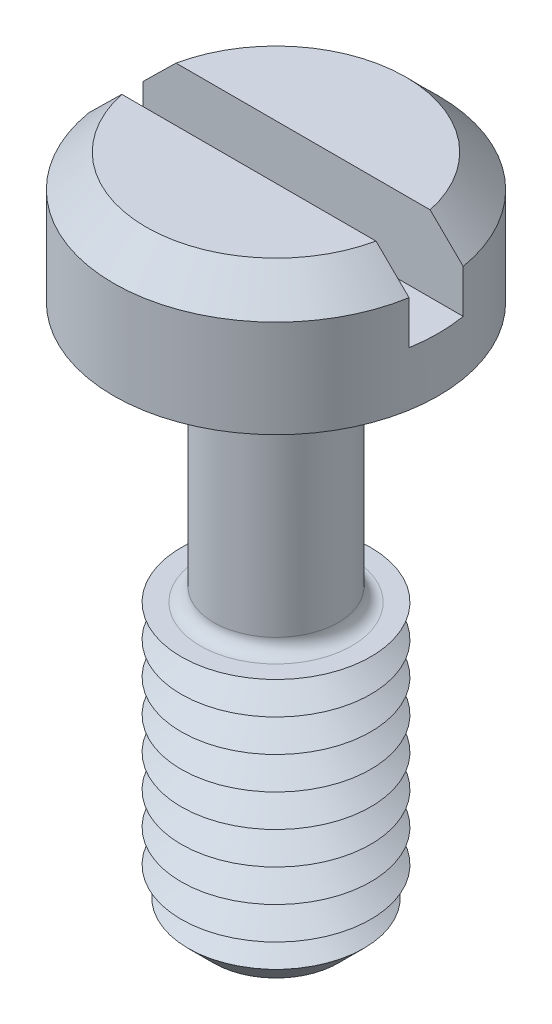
ISO-10303-21;
HEADER;
FILE_DESCRIPTION(('STEP AP214'),'2;1');
FILE_NAME('part.step','',(''),(''),'','','');
FILE_SCHEMA(('AUTOMOTIVE_DESIGN { 1 0 10303 214 1 1 1 1 }'));
ENDSEC;
DATA;
#1=APPLICATION_CONTEXT('core data for automotive mechanical design processes');
#2=APPLICATION_PROTOCOL_DEFINITION('international standard','automotive_design',2000,#1);
#3=PRODUCT_CONTEXT('',#1,'mechanical');
#4=PRODUCT('Part','Part','',(#3));
#5=PRODUCT_RELATED_PRODUCT_CATEGORY('part','',(#4));
#6=PRODUCT_DEFINITION_FORMATION('','',#4);
#7=PRODUCT_DEFINITION_CONTEXT('part definition',#1,'design');
#8=PRODUCT_DEFINITION('design','',#6,#7);
#9=PRODUCT_DEFINITION_SHAPE('','',#8);
#10=(LENGTH_UNIT() NAMED_UNIT(*) SI_UNIT(.MILLI.,.METRE.));
#11=(NAMED_UNIT(*) PLANE_ANGLE_UNIT() SI_UNIT($,.RADIAN.));
#12=(NAMED_UNIT(*) SI_UNIT($,.STERADIAN.) SOLID_ANGLE_UNIT());
#13=UNCERTAINTY_MEASURE_WITH_UNIT(LENGTH_MEASURE(1.E-05),#10,'distance_accuracy_value','');
#14=(GEOMETRIC_REPRESENTATION_CONTEXT(3) GLOBAL_UNCERTAINTY_ASSIGNED_CONTEXT((#13)) GLOBAL_UNIT_ASSIGNED_CONTEXT((#10,
#11,#12)) REPRESENTATION_CONTEXT('',''));
#15=CARTESIAN_POINT('',(0.,0.,0.));
#16=DIRECTION('',(0.,0.,1.));
#17=DIRECTION('',(1.,0.,0.));
#18=AXIS2_PLACEMENT_3D('',#15,#16,#17);
#19=CARTESIAN_POINT('',(0.,2.4,0.));
#20=DIRECTION('',(0.,1.,0.));
#21=DIRECTION('',(0.,0.,1.));
#22=AXIS2_PLACEMENT_3D('',#19,#20,#21);
#23=PLANE('',#22);
#24=DIRECTION('',(-1.,0.,0.));
#25=VECTOR('',#24,1.);
#26=CARTESIAN_POINT('',(3.,2.4,-0.5));
#27=LINE('',#26,#25);
#28=CARTESIAN_POINT('',(2.3473389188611,2.4,-0.5));
#29=VERTEX_POINT('',#28);
#30=CARTESIAN_POINT('',(-2.3473389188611,2.4,-0.5));
#31=VERTEX_POINT('',#30);
#32=EDGE_CURVE('E110',#29,#31,#27,.T.);
#33=ORIENTED_EDGE('',*,*,#32,.F.);
#34=CARTESIAN_POINT('',(0.,2.4,0.));
#35=DIRECTION('',(0.,1.,0.));
#36=DIRECTION('',(0.,0.,1.));
#37=AXIS2_PLACEMENT_3D('',#34,#35,#36);
#38=CIRCLE('',#37,2.4);
#39=EDGE_CURVE('E113',#29,#31,#38,.T.);
#40=ORIENTED_EDGE('',*,*,#39,.T.);
#41=EDGE_LOOP('',(#33,#40));
#42=FACE_BOUND('',#41,.T.);
#43=ADVANCED_FACE('F39',(#42),#23,.T.);
#44=CARTESIAN_POINT('',(0.,2.4,0.));
#45=DIRECTION('',(0.,-1.,0.));
#46=DIRECTION('',(0.,0.,-1.));
#47=AXIS2_PLACEMENT_3D('',#44,#45,#46);
#48=CONICAL_SURFACE('',#47,2.4,0.785398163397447);
#49=CARTESIAN_POINT('',(6.5992407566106,-1.81815522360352,-0.5));
#50=CARTESIAN_POINT('',(6.36552831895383,-1.58511655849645,-0.5));
#51=CARTESIAN_POINT('',(6.13178603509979,-1.35210779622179,-0.5));
#52=CARTESIAN_POINT('',(5.66419282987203,-0.886182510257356,-0.5));
#53=CARTESIAN_POINT('',(5.43034190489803,-0.653265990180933,-0.5));
#54=CARTESIAN_POINT('',(4.96229492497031,-0.187370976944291,-0.5));
#55=CARTESIAN_POINT('',(4.72809874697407,0.0456073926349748,-0.5));
#56=CARTESIAN_POINT('',(4.25949632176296,0.511336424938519,-0.5));
#57=CARTESIAN_POINT('',(4.02509008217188,0.744087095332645,-0.5));
#58=CARTESIAN_POINT('',(3.56605462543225,1.19918528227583,-0.5));
#59=CARTESIAN_POINT('',(3.34144041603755,1.42154792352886,-0.5));
#60=CARTESIAN_POINT('',(3.00406693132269,1.75465797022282,-0.5));
#61=CARTESIAN_POINT('',(2.89152775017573,1.8656282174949,-0.5));
#62=CARTESIAN_POINT('',(2.66624137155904,2.08735508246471,-0.5));
#63=CARTESIAN_POINT('',(2.5534941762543,2.19811170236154,-0.5));
#64=CARTESIAN_POINT('',(2.32775708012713,2.41925708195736,-0.5));
#65=CARTESIAN_POINT('',(2.21476734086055,2.52964600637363,-0.5));
#66=CARTESIAN_POINT('',(1.98831594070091,2.74994787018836,-0.5));
#67=CARTESIAN_POINT('',(1.87485426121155,2.85986079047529,-0.5));
#68=CARTESIAN_POINT('',(1.64719242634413,3.07888083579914,-0.5));
#69=CARTESIAN_POINT('',(1.53299241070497,3.18798810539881,-0.5));
#70=CARTESIAN_POINT('',(1.36063752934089,3.35052419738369,-0.5));
#71=CARTESIAN_POINT('',(1.3030119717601,3.40451369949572,-0.5));
#72=CARTESIAN_POINT('',(1.18725070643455,3.51194233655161,-0.5));
#73=CARTESIAN_POINT('',(1.12911501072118,3.56538148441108,-0.5));
#74=CARTESIAN_POINT('',(1.03810444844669,3.64783932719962,-0.5));
#75=CARTESIAN_POINT('',(1.00549358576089,3.67714917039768,-0.5));
#76=CARTESIAN_POINT('',(0.939964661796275,3.73543047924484,-0.5));
#77=CARTESIAN_POINT('',(0.90704657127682,3.76440191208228,-0.5));
#78=CARTESIAN_POINT('',(0.840581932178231,3.82209234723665,-0.5));
#79=CARTESIAN_POINT('',(0.807032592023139,3.85080814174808,-0.5));
#80=CARTESIAN_POINT('',(0.73940637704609,3.90759649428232,-0.5));
#81=CARTESIAN_POINT('',(0.7053296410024,3.93566921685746,-0.5));
#82=CARTESIAN_POINT('',(0.636165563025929,3.9911274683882,-0.5));
#83=CARTESIAN_POINT('',(0.601072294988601,4.01850564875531,-0.5));
#84=CARTESIAN_POINT('',(0.529844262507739,4.0718678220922,-0.5));
#85=CARTESIAN_POINT('',(0.493709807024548,4.09785222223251,-0.5));
#86=CARTESIAN_POINT('',(0.420142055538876,4.14747983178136,-0.5));
#87=CARTESIAN_POINT('',(0.382717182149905,4.17113535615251,-0.5));
#88=CARTESIAN_POINT('',(0.305809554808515,4.21475217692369,-0.5));
#89=CARTESIAN_POINT('',(0.266332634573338,4.234723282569,-0.5));
#90=CARTESIAN_POINT('',(0.194863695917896,4.26409059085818,-0.5));
#91=CARTESIAN_POINT('',(0.163467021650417,4.27488228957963,-0.5));
#92=CARTESIAN_POINT('',(0.0993951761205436,4.29114651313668,-0.5));
#93=CARTESIAN_POINT('',(0.0667267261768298,4.29664386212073,-0.5));
#94=CARTESIAN_POINT('',(0.000596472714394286,4.30109247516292,-0.5));
#95=CARTESIAN_POINT('',(-0.0328699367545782,4.29998037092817,-0.5));
#96=CARTESIAN_POINT('',(-0.0990204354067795,4.2913596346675,-0.5));
#97=CARTESIAN_POINT('',(-0.131701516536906,4.28382951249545,-0.5));
#98=CARTESIAN_POINT('',(-0.187595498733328,4.2664576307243,-0.5));
#99=CARTESIAN_POINT('',(-0.211151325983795,4.25764794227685,-0.5));
#100=CARTESIAN_POINT('',(-0.257419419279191,4.23801581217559,-0.5));
#101=CARTESIAN_POINT('',(-0.280131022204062,4.22719182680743,-0.5));
#102=CARTESIAN_POINT('',(-0.324887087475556,4.20402808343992,-0.5));
#103=CARTESIAN_POINT('',(-0.346927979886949,4.19168154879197,-0.5));
#104=CARTESIAN_POINT('',(-0.390350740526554,4.16590953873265,-0.5));
#105=CARTESIAN_POINT('',(-0.411732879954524,4.15248451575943,-0.5));
#106=CARTESIAN_POINT('',(-0.483200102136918,4.10572719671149,-0.5));
#107=CARTESIAN_POINT('',(-0.532069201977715,4.07054939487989,-0.5));
#108=CARTESIAN_POINT('',(-0.628034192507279,3.99783710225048,-0.5));
#109=CARTESIAN_POINT('',(-0.67512837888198,3.9603004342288,-0.5));
#110=CARTESIAN_POINT('',(-0.76827763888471,3.88373232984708,-0.5));
#111=CARTESIAN_POINT('',(-0.814329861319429,3.84469743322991,-0.5));
#112=CARTESIAN_POINT('',(-0.905640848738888,3.76575507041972,-0.5));
#113=CARTESIAN_POINT('',(-0.950899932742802,3.72584797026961,-0.5));
#114=CARTESIAN_POINT('',(-1.04097019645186,3.64535266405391,-0.5));
#115=CARTESIAN_POINT('',(-1.08578029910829,3.60476325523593,-0.5));
#116=CARTESIAN_POINT('',(-1.1750143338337,3.52315414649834,-0.5));
#117=CARTESIAN_POINT('',(-1.2194382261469,3.48213440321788,-0.5));
#118=CARTESIAN_POINT('',(-1.35214179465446,3.35874463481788,-0.5));
#119=CARTESIAN_POINT('',(-1.43999477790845,3.27591618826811,-0.5));
#120=CARTESIAN_POINT('',(-1.61421087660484,3.11033648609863,-0.5));
#121=CARTESIAN_POINT('',(-1.70058023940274,3.02759177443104,-0.5));
#122=CARTESIAN_POINT('',(-1.87288923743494,2.86165572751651,-0.5));
#123=CARTESIAN_POINT('',(-1.9588288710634,2.77846439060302,-0.5));
#124=CARTESIAN_POINT('',(-2.21622491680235,2.52844403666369,-0.5));
#125=CARTESIAN_POINT('',(-2.38725269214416,2.36117421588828,-0.5));
#126=CARTESIAN_POINT('',(-2.7288261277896,2.02593191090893,-0.5));
#127=CARTESIAN_POINT('',(-2.8993714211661,1.85795905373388,-0.5));
#128=CARTESIAN_POINT('',(-3.24010524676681,1.52165721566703,-0.5));
#129=CARTESIAN_POINT('',(-3.41029378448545,1.35332824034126,-0.5));
#130=CARTESIAN_POINT('',(-3.75003309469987,1.01685288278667,-0.5));
#131=CARTESIAN_POINT('',(-3.91958441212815,0.848707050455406,-0.5));
#132=CARTESIAN_POINT('',(-4.25853538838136,0.512261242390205,-0.5));
#133=CARTESIAN_POINT('',(-4.4279350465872,0.34396126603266,-0.5));
#134=CARTESIAN_POINT('',(-4.93592097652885,-0.161044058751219,-0.5));
#135=CARTESIAN_POINT('',(-5.2743487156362,-0.497908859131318,-0.5));
#136=CARTESIAN_POINT('',(-5.69486651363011,-0.9167696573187,-0.5));
#137=CARTESIAN_POINT('',(-5.77706453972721,-0.998657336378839,-0.5));
#138=CARTESIAN_POINT('',(-5.94145013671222,-1.16244746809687,-0.5));
#139=CARTESIAN_POINT('',(-6.02363770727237,-1.24434992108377,-0.5));
#140=CARTESIAN_POINT('',(-6.18806790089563,-1.40823159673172,-0.5));
#141=CARTESIAN_POINT('',(-6.27031051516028,-1.49021082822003,-0.5));
#142=CARTESIAN_POINT('',(-6.43478378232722,-1.65417699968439,-0.5));
#143=CARTESIAN_POINT('',(-6.51701443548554,-1.73616393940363,-0.5));
#144=CARTESIAN_POINT('',(-6.5992407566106,-1.81815522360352,-0.5));
#145=B_SPLINE_CURVE_WITH_KNOTS('',3,(#49,#50,#51,#52,#53,#54,#55,#56,#57,#58,#59,#60,#61,#62,
#63,#64,#65,#66,#67,#68,#69,#70,#71,#72,#73,#74,#75,#76,#77,#78,#79,#80,#81,#82,#83,#84,#85,#86,
#87,#88,#89,#90,#91,#92,#93,#94,#95,#96,#97,#98,#99,#100,#101,#102,#103,#104,#105,#106,#107,
#108,#109,#110,#111,#112,#113,#114,#115,#116,#117,#118,#119,#120,#121,#122,#123,#124,#125,#126,
#127,#128,#129,#130,#131,#132,#133,#134,#135,#136,#137,#138,#139,#140,#141,#142,#143,#144),
.UNSPECIFIED.,.F.,.F.,(4,2,2,2,2,2,2,2,2,2,2,2,2,2,2,2,2,2,2,2,2,2,2,2,2,2,2,2,2,2,2,2,2,2,2,2,
2,2,2,2,2,2,2,2,2,2,2,4),(0.,0.990129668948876,1.98029489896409,2.97132503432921,
3.96232055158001,4.91051293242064,5.384659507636,5.85880117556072,6.33268991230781,
6.80659750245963,7.28041788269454,7.51731276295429,7.75420207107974,7.88574051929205,
8.01729161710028,8.14976780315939,8.28220970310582,8.41571746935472,8.54918601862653,
8.68190589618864,8.81426715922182,8.91354607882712,9.01235719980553,9.1121171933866,
9.21221254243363,9.28755627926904,9.36295799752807,9.43870832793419,9.51442704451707,
9.69490147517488,9.87554500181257,10.0566343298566,10.2376490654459,10.4190258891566,
10.6004211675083,10.9626397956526,11.3214656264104,11.6802927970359,12.3979711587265,
13.1160968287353,13.8342113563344,14.5505812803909,15.2669541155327,16.6994694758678,
17.0475484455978,17.3956364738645,17.7440040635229,18.0923625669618),.UNSPECIFIED.);
#146=CARTESIAN_POINT('',(2.95803989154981,1.8,-0.5));
#147=VERTEX_POINT('',#146);
#148=EDGE_CURVE('E258',#147,#29,#145,.T.);
#149=ORIENTED_EDGE('',*,*,#148,.F.);
#150=CARTESIAN_POINT('',(0.,1.8,0.));
#151=DIRECTION('',(0.,1.,0.));
#152=DIRECTION('',(0.,0.,1.));
#153=AXIS2_PLACEMENT_3D('',#150,#151,#152);
#154=CIRCLE('',#153,3.);
#155=CARTESIAN_POINT('',(-2.95803989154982,1.8,-0.5));
#156=VERTEX_POINT('',#155);
#157=EDGE_CURVE('E126',#156,#147,#154,.F.);
#158=ORIENTED_EDGE('',*,*,#157,.F.);
#159=EDGE_CURVE('E102',#31,#156,#145,.T.);
#160=ORIENTED_EDGE('',*,*,#159,.F.);
#161=ORIENTED_EDGE('',*,*,#39,.F.);
#162=EDGE_LOOP('',(#149,#158,#160,#161));
#163=FACE_BOUND('',#162,.T.);
#164=ADVANCED_FACE('F220',(#163),#48,.T.);
#165=CARTESIAN_POINT('',(0.,-10.,0.));
#166=DIRECTION('',(0.,1.,0.));
#167=DIRECTION('',(0.,0.,1.));
#168=AXIS2_PLACEMENT_3D('',#165,#166,#167);
#169=CYLINDRICAL_SURFACE('',#168,1.15);
#170=CARTESIAN_POINT('',(0.,-4.55,0.));
#171=DIRECTION('',(0.,-1.,0.));
#172=DIRECTION('',(0.,0.,-1.));
#173=AXIS2_PLACEMENT_3D('',#170,#171,#172);
#174=CIRCLE('',#173,1.15);
#175=CARTESIAN_POINT('',(0.,-4.55,-1.15));
#176=VERTEX_POINT('',#175);
#177=EDGE_CURVE('E121',#176,#176,#174,.F.);
#178=ORIENTED_EDGE('',*,*,#177,.T.);
#179=EDGE_LOOP('',(#178));
#180=FACE_BOUND('',#179,.T.);
#181=CARTESIAN_POINT('',(0.,-0.25,0.));
#182=DIRECTION('',(0.,1.,0.));
#183=DIRECTION('',(0.,0.,1.));
#184=AXIS2_PLACEMENT_3D('',#181,#182,#183);
#185=CIRCLE('',#184,1.15);
#186=CARTESIAN_POINT('',(0.,-0.25,1.15));
#187=VERTEX_POINT('',#186);
#188=EDGE_CURVE('E365',#187,#187,#185,.F.);
#189=ORIENTED_EDGE('',*,*,#188,.T.);
#190=EDGE_LOOP('',(#189));
#191=FACE_BOUND('',#190,.T.);
#192=ADVANCED_FACE('F216',(#180,#191),#169,.T.);
#193=CARTESIAN_POINT('',(0.,2.4,0.));
#194=DIRECTION('',(0.,-1.,0.));
#195=DIRECTION('',(0.,0.,-1.));
#196=AXIS2_PLACEMENT_3D('',#193,#194,#195);
#197=CYLINDRICAL_SURFACE('',#196,3.);
#198=ORIENTED_EDGE('',*,*,#157,.T.);
#199=DIRECTION('',(0.,-1.,0.));
#200=VECTOR('',#199,1.);
#201=CARTESIAN_POINT('',(2.95803989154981,2.4,-0.5));
#202=LINE('',#201,#200);
#203=CARTESIAN_POINT('',(2.95803989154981,1.,-0.5));
#204=VERTEX_POINT('',#203);
#205=EDGE_CURVE('E64',#147,#204,#202,.T.);
#206=ORIENTED_EDGE('',*,*,#205,.T.);
#207=CARTESIAN_POINT('',(0.,1.,0.));
#208=DIRECTION('',(0.,1.,0.));
#209=DIRECTION('',(0.,0.,1.));
#210=AXIS2_PLACEMENT_3D('',#207,#208,#209);
#211=CIRCLE('',#210,3.);
#212=CARTESIAN_POINT('',(2.95803989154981,1.,0.5));
#213=VERTEX_POINT('',#212);
#214=EDGE_CURVE('E11',#213,#204,#211,.T.);
#215=ORIENTED_EDGE('',*,*,#214,.F.);
#216=DIRECTION('',(0.,-1.,0.));
#217=VECTOR('',#216,1.);
#218=CARTESIAN_POINT('',(2.95803989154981,2.4,0.5));
#219=LINE('',#218,#217);
#220=CARTESIAN_POINT('',(2.95803989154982,1.8,0.5));
#221=VERTEX_POINT('',#220);
#222=EDGE_CURVE('E275',#213,#221,#219,.F.);
#223=ORIENTED_EDGE('',*,*,#222,.T.);
#224=CARTESIAN_POINT('',(-2.95803989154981,1.8,0.5));
#225=VERTEX_POINT('',#224);
#226=EDGE_CURVE('E118',#221,#225,#154,.F.);
#227=ORIENTED_EDGE('',*,*,#226,.T.);
#228=DIRECTION('',(0.,-1.,0.));
#229=VECTOR('',#228,1.);
#230=CARTESIAN_POINT('',(-2.95803989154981,2.4,0.5));
#231=LINE('',#230,#229);
#232=CARTESIAN_POINT('',(-2.95803989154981,1.,0.5));
#233=VERTEX_POINT('',#232);
#234=EDGE_CURVE('E96',#225,#233,#231,.T.);
#235=ORIENTED_EDGE('',*,*,#234,.T.);
#236=CARTESIAN_POINT('',(-2.95803989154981,1.,-0.5));
#237=VERTEX_POINT('',#236);
#238=EDGE_CURVE('E44',#237,#233,#211,.T.);
#239=ORIENTED_EDGE('',*,*,#238,.F.);
#240=DIRECTION('',(0.,-1.,0.));
#241=VECTOR('',#240,1.);
#242=CARTESIAN_POINT('',(-2.95803989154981,2.4,-0.5));
#243=LINE('',#242,#241);
#244=EDGE_CURVE('E279',#237,#156,#243,.F.);
#245=ORIENTED_EDGE('',*,*,#244,.T.);
#246=EDGE_LOOP('',(#198,#206,#215,#223,#227,#235,#239,#245));
#247=FACE_BOUND('',#246,.T.);
#248=CARTESIAN_POINT('',(0.,0.,0.));
#249=DIRECTION('',(0.,1.,0.));
#250=DIRECTION('',(0.,0.,1.));
#251=AXIS2_PLACEMENT_3D('',#248,#249,#250);
#252=CIRCLE('',#251,3.);
#253=CARTESIAN_POINT('',(0.,0.,3.));
#254=VERTEX_POINT('',#253);
#255=EDGE_CURVE('E351',#254,#254,#252,.T.);
#256=ORIENTED_EDGE('',*,*,#255,.T.);
#257=EDGE_LOOP('',(#256));
#258=FACE_BOUND('',#257,.T.);
#259=ADVANCED_FACE('F219',(#247,#258),#197,.T.);
#260=DIRECTION('',(1.,0.,0.));
#261=VECTOR('',#260,1.);
#262=CARTESIAN_POINT('',(3.,2.4,0.5));
#263=LINE('',#262,#261);
#264=CARTESIAN_POINT('',(-2.3473389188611,2.4,0.5));
#265=VERTEX_POINT('',#264);
#266=CARTESIAN_POINT('',(2.3473389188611,2.4,0.5));
#267=VERTEX_POINT('',#266);
#268=EDGE_CURVE('E56',#265,#267,#263,.T.);
#269=ORIENTED_EDGE('',*,*,#268,.F.);
#270=EDGE_CURVE('E108',#265,#267,#38,.T.);
#271=ORIENTED_EDGE('',*,*,#270,.T.);
#272=EDGE_LOOP('',(#269,#271));
#273=FACE_BOUND('',#272,.T.);
#274=ADVANCED_FACE('F107',(#273),#23,.T.);
#275=CARTESIAN_POINT('',(0.,0.,0.));
#276=DIRECTION('',(0.,1.,0.));
#277=DIRECTION('',(0.,0.,1.));
#278=AXIS2_PLACEMENT_3D('',#275,#276,#277);
#279=PLANE('',#278);
#280=CARTESIAN_POINT('',(0.,0.,0.));
#281=DIRECTION('',(0.,1.,0.));
#282=DIRECTION('',(0.,0.,1.));
#283=AXIS2_PLACEMENT_3D('',#280,#281,#282);
#284=CIRCLE('',#283,1.4);
#285=CARTESIAN_POINT('',(0.,0.,1.4));
#286=VERTEX_POINT('',#285);
#287=EDGE_CURVE('E114',#286,#286,#284,.T.);
#288=ORIENTED_EDGE('',*,*,#287,.T.);
#289=EDGE_LOOP('',(#288));
#290=FACE_BOUND('',#289,.T.);
#291=ORIENTED_EDGE('',*,*,#255,.F.);
#292=EDGE_LOOP('',(#291));
#293=FACE_BOUND('',#292,.T.);
#294=ADVANCED_FACE('F210',(#290,#293),#279,.F.);
#295=CARTESIAN_POINT('',(0.,-4.8,0.));
#296=DIRECTION('',(0.,-1.,0.));
#297=DIRECTION('',(0.,0.,-1.));
#298=AXIS2_PLACEMENT_3D('',#295,#296,#297);
#299=PLANE('',#298);
#300=CARTESIAN_POINT('',(0.,-4.8,0.));
#301=DIRECTION('',(0.,-1.,0.));
#302=DIRECTION('',(0.,0.,-1.));
#303=AXIS2_PLACEMENT_3D('',#300,#301,#302);
#304=CIRCLE('',#303,1.4);
#305=CARTESIAN_POINT('',(0.,-4.8,-1.4));
#306=VERTEX_POINT('',#305);
#307=EDGE_CURVE('E358',#306,#306,#304,.T.);
#308=ORIENTED_EDGE('',*,*,#307,.T.);
#309=EDGE_LOOP('',(#308));
#310=FACE_BOUND('',#309,.T.);
#311=CARTESIAN_POINT('',(0.,-4.8,0.));
#312=DIRECTION('',(0.,1.,0.));
#313=DIRECTION('',(0.,0.,1.));
#314=AXIS2_PLACEMENT_3D('',#311,#312,#313);
#315=CIRCLE('',#314,1.75);
#316=CARTESIAN_POINT('',(0.,-4.8,1.75));
#317=VERTEX_POINT('',#316);
#318=EDGE_CURVE('E348',#317,#317,#315,.T.);
#319=ORIENTED_EDGE('',*,*,#318,.T.);
#320=EDGE_LOOP('',(#319));
#321=FACE_BOUND('',#320,.T.);
#322=ADVANCED_FACE('F206',(#310,#321),#299,.F.);
#323=CARTESIAN_POINT('',(0.,-5.1,0.));
#324=DIRECTION('',(0.,1.,0.));
#325=DIRECTION('',(0.,0.,1.));
#326=AXIS2_PLACEMENT_3D('',#323,#324,#325);
#327=CONICAL_SURFACE('',#326,1.23038475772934,1.0471975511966);
#328=ORIENTED_EDGE('',*,*,#318,.F.);
#329=EDGE_LOOP('',(#328));
#330=FACE_BOUND('',#329,.T.);
#331=CARTESIAN_POINT('',(0.,-5.1,0.));
#332=DIRECTION('',(0.,1.,0.));
#333=DIRECTION('',(0.,0.,1.));
#334=AXIS2_PLACEMENT_3D('',#331,#332,#333);
#335=CIRCLE('',#334,1.23038475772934);
#336=CARTESIAN_POINT('',(0.,-5.1,1.23038475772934));
#337=VERTEX_POINT('',#336);
#338=EDGE_CURVE('E344',#337,#337,#335,.T.);
#339=ORIENTED_EDGE('',*,*,#338,.T.);
#340=EDGE_LOOP('',(#339));
#341=FACE_BOUND('',#340,.T.);
#342=ADVANCED_FACE('F202',(#330,#341),#327,.T.);
#343=CARTESIAN_POINT('',(0.,-5.4,0.));
#344=DIRECTION('',(0.,-1.,0.));
#345=DIRECTION('',(0.,0.,-1.));
#346=AXIS2_PLACEMENT_3D('',#343,#344,#345);
#347=CONICAL_SURFACE('',#346,1.75,1.0471975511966);
#348=ORIENTED_EDGE('',*,*,#338,.F.);
#349=EDGE_LOOP('',(#348));
#350=FACE_BOUND('',#349,.T.);
#351=CARTESIAN_POINT('',(0.,-5.4,0.));
#352=DIRECTION('',(0.,1.,0.));
#353=DIRECTION('',(0.,0.,1.));
#354=AXIS2_PLACEMENT_3D('',#351,#352,#353);
#355=CIRCLE('',#354,1.75);
#356=CARTESIAN_POINT('',(0.,-5.4,1.75));
#357=VERTEX_POINT('',#356);
#358=EDGE_CURVE('E341',#357,#357,#355,.T.);
#359=ORIENTED_EDGE('',*,*,#358,.T.);
#360=EDGE_LOOP('',(#359));
#361=FACE_BOUND('',#360,.T.);
#362=ADVANCED_FACE('F198',(#350,#361),#347,.T.);
#363=CARTESIAN_POINT('',(0.,-5.7,0.));
#364=DIRECTION('',(0.,1.,0.));
#365=DIRECTION('',(0.,0.,1.));
#366=AXIS2_PLACEMENT_3D('',#363,#364,#365);
#367=CONICAL_SURFACE('',#366,1.23038475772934,1.0471975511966);
#368=ORIENTED_EDGE('',*,*,#358,.F.);
#369=EDGE_LOOP('',(#368));
#370=FACE_BOUND('',#369,.T.);
#371=CARTESIAN_POINT('',(0.,-5.7,0.));
#372=DIRECTION('',(0.,1.,0.));
#373=DIRECTION('',(0.,0.,1.));
#374=AXIS2_PLACEMENT_3D('',#371,#372,#373);
#375=CIRCLE('',#374,1.23038475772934);
#376=CARTESIAN_POINT('',(0.,-5.7,1.23038475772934));
#377=VERTEX_POINT('',#376);
#378=EDGE_CURVE('E337',#377,#377,#375,.T.);
#379=ORIENTED_EDGE('',*,*,#378,.T.);
#380=EDGE_LOOP('',(#379));
#381=FACE_BOUND('',#380,.T.);
#382=ADVANCED_FACE('F194',(#370,#381),#367,.T.);
#383=CARTESIAN_POINT('',(0.,-6.,0.));
#384=DIRECTION('',(0.,-1.,0.));
#385=DIRECTION('',(0.,0.,-1.));
#386=AXIS2_PLACEMENT_3D('',#383,#384,#385);
#387=CONICAL_SURFACE('',#386,1.75,1.0471975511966);
#388=ORIENTED_EDGE('',*,*,#378,.F.);
#389=EDGE_LOOP('',(#388));
#390=FACE_BOUND('',#389,.T.);
#391=CARTESIAN_POINT('',(0.,-6.,0.));
#392=DIRECTION('',(0.,1.,0.));
#393=DIRECTION('',(0.,0.,1.));
#394=AXIS2_PLACEMENT_3D('',#391,#392,#393);
#395=CIRCLE('',#394,1.75);
#396=CARTESIAN_POINT('',(0.,-6.,1.75));
#397=VERTEX_POINT('',#396);
#398=EDGE_CURVE('E333',#397,#397,#395,.T.);
#399=ORIENTED_EDGE('',*,*,#398,.T.);
#400=EDGE_LOOP('',(#399));
#401=FACE_BOUND('',#400,.T.);
#402=ADVANCED_FACE('F190',(#390,#401),#387,.T.);
#403=CARTESIAN_POINT('',(0.,-6.3,0.));
#404=DIRECTION('',(0.,1.,0.));
#405=DIRECTION('',(0.,0.,1.));
#406=AXIS2_PLACEMENT_3D('',#403,#404,#405);
#407=CONICAL_SURFACE('',#406,1.23038475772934,1.0471975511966);
#408=ORIENTED_EDGE('',*,*,#398,.F.);
#409=EDGE_LOOP('',(#408));
#410=FACE_BOUND('',#409,.T.);
#411=CARTESIAN_POINT('',(0.,-6.3,0.));
#412=DIRECTION('',(0.,1.,0.));
#413=DIRECTION('',(0.,0.,1.));
#414=AXIS2_PLACEMENT_3D('',#411,#412,#413);
#415=CIRCLE('',#414,1.23038475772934);
#416=CARTESIAN_POINT('',(0.,-6.3,1.23038475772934));
#417=VERTEX_POINT('',#416);
#418=EDGE_CURVE('E329',#417,#417,#415,.T.);
#419=ORIENTED_EDGE('',*,*,#418,.T.);
#420=EDGE_LOOP('',(#419));
#421=FACE_BOUND('',#420,.T.);
#422=ADVANCED_FACE('F186',(#410,#421),#407,.T.);
#423=CARTESIAN_POINT('',(0.,-6.6,0.));
#424=DIRECTION('',(0.,-1.,0.));
#425=DIRECTION('',(0.,0.,-1.));
#426=AXIS2_PLACEMENT_3D('',#423,#424,#425);
#427=CONICAL_SURFACE('',#426,1.75,1.0471975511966);
#428=ORIENTED_EDGE('',*,*,#418,.F.);
#429=EDGE_LOOP('',(#428));
#430=FACE_BOUND('',#429,.T.);
#431=CARTESIAN_POINT('',(0.,-6.6,0.));
#432=DIRECTION('',(0.,1.,0.));
#433=DIRECTION('',(0.,0.,1.));
#434=AXIS2_PLACEMENT_3D('',#431,#432,#433);
#435=CIRCLE('',#434,1.75);
#436=CARTESIAN_POINT('',(0.,-6.6,1.75));
#437=VERTEX_POINT('',#436);
#438=EDGE_CURVE('E325',#437,#437,#435,.T.);
#439=ORIENTED_EDGE('',*,*,#438,.T.);
#440=EDGE_LOOP('',(#439));
#441=FACE_BOUND('',#440,.T.);
#442=ADVANCED_FACE('F182',(#430,#441),#427,.T.);
#443=CARTESIAN_POINT('',(0.,-6.9,0.));
#444=DIRECTION('',(0.,1.,0.));
#445=DIRECTION('',(0.,0.,1.));
#446=AXIS2_PLACEMENT_3D('',#443,#444,#445);
#447=CONICAL_SURFACE('',#446,1.23038475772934,1.0471975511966);
#448=ORIENTED_EDGE('',*,*,#438,.F.);
#449=EDGE_LOOP('',(#448));
#450=FACE_BOUND('',#449,.T.);
#451=CARTESIAN_POINT('',(0.,-6.9,0.));
#452=DIRECTION('',(0.,1.,0.));
#453=DIRECTION('',(0.,0.,1.));
#454=AXIS2_PLACEMENT_3D('',#451,#452,#453);
#455=CIRCLE('',#454,1.23038475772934);
#456=CARTESIAN_POINT('',(0.,-6.9,1.23038475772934));
#457=VERTEX_POINT('',#456);
#458=EDGE_CURVE('E321',#457,#457,#455,.T.);
#459=ORIENTED_EDGE('',*,*,#458,.T.);
#460=EDGE_LOOP('',(#459));
#461=FACE_BOUND('',#460,.T.);
#462=ADVANCED_FACE('F178',(#450,#461),#447,.T.);
#463=CARTESIAN_POINT('',(0.,-7.2,0.));
#464=DIRECTION('',(0.,-1.,0.));
#465=DIRECTION('',(0.,0.,-1.));
#466=AXIS2_PLACEMENT_3D('',#463,#464,#465);
#467=CONICAL_SURFACE('',#466,1.75,1.0471975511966);
#468=ORIENTED_EDGE('',*,*,#458,.F.);
#469=EDGE_LOOP('',(#468));
#470=FACE_BOUND('',#469,.T.);
#471=CARTESIAN_POINT('',(0.,-7.2,0.));
#472=DIRECTION('',(0.,1.,0.));
#473=DIRECTION('',(0.,0.,1.));
#474=AXIS2_PLACEMENT_3D('',#471,#472,#473);
#475=CIRCLE('',#474,1.75);
#476=CARTESIAN_POINT('',(0.,-7.2,1.75));
#477=VERTEX_POINT('',#476);
#478=EDGE_CURVE('E317',#477,#477,#475,.T.);
#479=ORIENTED_EDGE('',*,*,#478,.T.);
#480=EDGE_LOOP('',(#479));
#481=FACE_BOUND('',#480,.T.);
#482=ADVANCED_FACE('F174',(#470,#481),#467,.T.);
#483=CARTESIAN_POINT('',(0.,-7.5,0.));
#484=DIRECTION('',(0.,1.,0.));
#485=DIRECTION('',(0.,0.,1.));
#486=AXIS2_PLACEMENT_3D('',#483,#484,#485);
#487=CONICAL_SURFACE('',#486,1.23038475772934,1.0471975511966);
#488=ORIENTED_EDGE('',*,*,#478,.F.);
#489=EDGE_LOOP('',(#488));
#490=FACE_BOUND('',#489,.T.);
#491=CARTESIAN_POINT('',(0.,-7.5,0.));
#492=DIRECTION('',(0.,1.,0.));
#493=DIRECTION('',(0.,0.,1.));
#494=AXIS2_PLACEMENT_3D('',#491,#492,#493);
#495=CIRCLE('',#494,1.23038475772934);
#496=CARTESIAN_POINT('',(0.,-7.5,1.23038475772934));
#497=VERTEX_POINT('',#496);
#498=EDGE_CURVE('E313',#497,#497,#495,.T.);
#499=ORIENTED_EDGE('',*,*,#498,.T.);
#500=EDGE_LOOP('',(#499));
#501=FACE_BOUND('',#500,.T.);
#502=ADVANCED_FACE('F170',(#490,#501),#487,.T.);
#503=CARTESIAN_POINT('',(0.,-7.8,0.));
#504=DIRECTION('',(0.,-1.,0.));
#505=DIRECTION('',(0.,0.,-1.));
#506=AXIS2_PLACEMENT_3D('',#503,#504,#505);
#507=CONICAL_SURFACE('',#506,1.75,1.0471975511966);
#508=ORIENTED_EDGE('',*,*,#498,.F.);
#509=EDGE_LOOP('',(#508));
#510=FACE_BOUND('',#509,.T.);
#511=CARTESIAN_POINT('',(0.,-7.8,0.));
#512=DIRECTION('',(0.,1.,0.));
#513=DIRECTION('',(0.,0.,1.));
#514=AXIS2_PLACEMENT_3D('',#511,#512,#513);
#515=CIRCLE('',#514,1.75);
#516=CARTESIAN_POINT('',(0.,-7.8,1.75));
#517=VERTEX_POINT('',#516);
#518=EDGE_CURVE('E309',#517,#517,#515,.T.);
#519=ORIENTED_EDGE('',*,*,#518,.T.);
#520=EDGE_LOOP('',(#519));
#521=FACE_BOUND('',#520,.T.);
#522=ADVANCED_FACE('F166',(#510,#521),#507,.T.);
#523=CARTESIAN_POINT('',(0.,-8.1,0.));
#524=DIRECTION('',(0.,1.,0.));
#525=DIRECTION('',(0.,0.,1.));
#526=AXIS2_PLACEMENT_3D('',#523,#524,#525);
#527=CONICAL_SURFACE('',#526,1.23038475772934,1.0471975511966);
#528=ORIENTED_EDGE('',*,*,#518,.F.);
#529=EDGE_LOOP('',(#528));
#530=FACE_BOUND('',#529,.T.);
#531=CARTESIAN_POINT('',(0.,-8.1,0.));
#532=DIRECTION('',(0.,1.,0.));
#533=DIRECTION('',(0.,0.,1.));
#534=AXIS2_PLACEMENT_3D('',#531,#532,#533);
#535=CIRCLE('',#534,1.23038475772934);
#536=CARTESIAN_POINT('',(0.,-8.1,1.23038475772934));
#537=VERTEX_POINT('',#536);
#538=EDGE_CURVE('E305',#537,#537,#535,.T.);
#539=ORIENTED_EDGE('',*,*,#538,.T.);
#540=EDGE_LOOP('',(#539));
#541=FACE_BOUND('',#540,.T.);
#542=ADVANCED_FACE('F162',(#530,#541),#527,.T.);
#543=CARTESIAN_POINT('',(0.,-8.4,0.));
#544=DIRECTION('',(0.,-1.,0.));
#545=DIRECTION('',(0.,0.,-1.));
#546=AXIS2_PLACEMENT_3D('',#543,#544,#545);
#547=CONICAL_SURFACE('',#546,1.75,1.0471975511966);
#548=ORIENTED_EDGE('',*,*,#538,.F.);
#549=EDGE_LOOP('',(#548));
#550=FACE_BOUND('',#549,.T.);
#551=CARTESIAN_POINT('',(0.,-8.4,0.));
#552=DIRECTION('',(0.,1.,0.));
#553=DIRECTION('',(0.,0.,1.));
#554=AXIS2_PLACEMENT_3D('',#551,#552,#553);
#555=CIRCLE('',#554,1.75);
#556=CARTESIAN_POINT('',(0.,-8.4,1.75));
#557=VERTEX_POINT('',#556);
#558=EDGE_CURVE('E301',#557,#557,#555,.T.);
#559=ORIENTED_EDGE('',*,*,#558,.T.);
#560=EDGE_LOOP('',(#559));
#561=FACE_BOUND('',#560,.T.);
#562=ADVANCED_FACE('F158',(#550,#561),#547,.T.);
#563=CARTESIAN_POINT('',(0.,-8.7,0.));
#564=DIRECTION('',(0.,1.,0.));
#565=DIRECTION('',(0.,0.,1.));
#566=AXIS2_PLACEMENT_3D('',#563,#564,#565);
#567=CONICAL_SURFACE('',#566,1.23038475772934,1.0471975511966);
#568=ORIENTED_EDGE('',*,*,#558,.F.);
#569=EDGE_LOOP('',(#568));
#570=FACE_BOUND('',#569,.T.);
#571=CARTESIAN_POINT('',(0.,-8.7,0.));
#572=DIRECTION('',(0.,1.,0.));
#573=DIRECTION('',(0.,0.,1.));
#574=AXIS2_PLACEMENT_3D('',#571,#572,#573);
#575=CIRCLE('',#574,1.23038475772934);
#576=CARTESIAN_POINT('',(0.,-8.7,1.23038475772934));
#577=VERTEX_POINT('',#576);
#578=EDGE_CURVE('E297',#577,#577,#575,.T.);
#579=ORIENTED_EDGE('',*,*,#578,.T.);
#580=EDGE_LOOP('',(#579));
#581=FACE_BOUND('',#580,.T.);
#582=ADVANCED_FACE('F154',(#570,#581),#567,.T.);
#583=CARTESIAN_POINT('',(0.,-9.,0.));
#584=DIRECTION('',(0.,-1.,0.));
#585=DIRECTION('',(0.,0.,-1.));
#586=AXIS2_PLACEMENT_3D('',#583,#584,#585);
#587=CONICAL_SURFACE('',#586,1.75,1.0471975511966);
#588=ORIENTED_EDGE('',*,*,#578,.F.);
#589=EDGE_LOOP('',(#588));
#590=FACE_BOUND('',#589,.T.);
#591=CARTESIAN_POINT('',(0.,-9.,0.));
#592=DIRECTION('',(0.,1.,0.));
#593=DIRECTION('',(0.,0.,1.));
#594=AXIS2_PLACEMENT_3D('',#591,#592,#593);
#595=CIRCLE('',#594,1.75);
#596=CARTESIAN_POINT('',(0.,-9.,1.75));
#597=VERTEX_POINT('',#596);
#598=EDGE_CURVE('E292',#597,#597,#595,.T.);
#599=ORIENTED_EDGE('',*,*,#598,.T.);
#600=EDGE_LOOP('',(#599));
#601=FACE_BOUND('',#600,.T.);
#602=ADVANCED_FACE('F150',(#590,#601),#587,.T.);
#603=CARTESIAN_POINT('',(0.,-9.3,0.));
#604=DIRECTION('',(0.,1.,0.));
#605=DIRECTION('',(0.,0.,1.));
#606=AXIS2_PLACEMENT_3D('',#603,#604,#605);
#607=CONICAL_SURFACE('',#606,1.23038475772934,1.0471975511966);
#608=ORIENTED_EDGE('',*,*,#598,.F.);
#609=EDGE_LOOP('',(#608));
#610=FACE_BOUND('',#609,.T.);
#611=CARTESIAN_POINT('',(0.,-9.3,0.));
#612=DIRECTION('',(0.,1.,0.));
#613=DIRECTION('',(0.,0.,1.));
#614=AXIS2_PLACEMENT_3D('',#611,#612,#613);
#615=CIRCLE('',#614,1.23038475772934);
#616=CARTESIAN_POINT('',(0.,-9.3,1.23038475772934));
#617=VERTEX_POINT('',#616);
#618=EDGE_CURVE('E288',#617,#617,#615,.T.);
#619=ORIENTED_EDGE('',*,*,#618,.T.);
#620=EDGE_LOOP('',(#619));
#621=FACE_BOUND('',#620,.T.);
#622=ADVANCED_FACE('F146',(#610,#621),#607,.T.);
#623=CARTESIAN_POINT('',(0.,-9.6,0.));
#624=DIRECTION('',(0.,-1.,0.));
#625=DIRECTION('',(0.,0.,-1.));
#626=AXIS2_PLACEMENT_3D('',#623,#624,#625);
#627=CONICAL_SURFACE('',#626,1.75,1.0471975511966);
#628=CARTESIAN_POINT('',(0.,-9.52679491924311,0.));
#629=DIRECTION('',(0.,-1.,0.));
#630=DIRECTION('',(0.,0.,-1.));
#631=AXIS2_PLACEMENT_3D('',#628,#629,#630);
#632=CIRCLE('',#631,1.62320508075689);
#633=CARTESIAN_POINT('',(0.,-9.52679491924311,1.62320508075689));
#634=VERTEX_POINT('',#633);
#635=EDGE_CURVE('E296',#634,#634,#632,.F.);
#636=ORIENTED_EDGE('',*,*,#635,.T.);
#637=EDGE_LOOP('',(#636));
#638=FACE_BOUND('',#637,.T.);
#639=ORIENTED_EDGE('',*,*,#618,.F.);
#640=EDGE_LOOP('',(#639));
#641=FACE_BOUND('',#640,.T.);
#642=ADVANCED_FACE('F142',(#638,#641),#627,.T.);
#643=CARTESIAN_POINT('',(0.,-10.,0.));
#644=DIRECTION('',(0.,-1.,0.));
#645=DIRECTION('',(0.,0.,-1.));
#646=AXIS2_PLACEMENT_3D('',#643,#644,#645);
#647=PLANE('',#646);
#648=CARTESIAN_POINT('',(0.,-10.,0.));
#649=DIRECTION('',(0.,-1.,0.));
#650=DIRECTION('',(0.,0.,-1.));
#651=AXIS2_PLACEMENT_3D('',#648,#649,#650);
#652=CIRCLE('',#651,1.15);
#653=CARTESIAN_POINT('',(0.,-10.,1.15));
#654=VERTEX_POINT('',#653);
#655=EDGE_CURVE('E355',#654,#654,#652,.T.);
#656=ORIENTED_EDGE('',*,*,#655,.T.);
#657=EDGE_LOOP('',(#656));
#658=FACE_BOUND('',#657,.T.);
#659=ADVANCED_FACE('F145',(#658),#647,.T.);
#660=CARTESIAN_POINT('',(0.,-10.,0.));
#661=DIRECTION('',(0.,1.,0.));
#662=DIRECTION('',(0.,0.,1.));
#663=AXIS2_PLACEMENT_3D('',#660,#661,#662);
#664=CONICAL_SURFACE('',#663,1.15,0.785398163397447);
#665=CARTESIAN_POINT('',(0.,-9.52679491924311,1.62320508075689));
#666=CARTESIAN_POINT('',(0.,-9.53172413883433,1.61827586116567));
#667=CARTESIAN_POINT('',(0.,-9.53665335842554,1.61334664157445));
#668=CARTESIAN_POINT('',(0.,-9.54651179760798,1.60348820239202));
#669=CARTESIAN_POINT('',(0.,-9.5514410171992,1.5985589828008));
#670=CARTESIAN_POINT('',(0.,-9.56129945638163,1.58870054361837));
#671=CARTESIAN_POINT('',(0.,-9.56622867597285,1.58377132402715));
#672=CARTESIAN_POINT('',(0.,-9.57608711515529,1.57391288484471));
#673=CARTESIAN_POINT('',(0.,-9.5810163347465,1.5689836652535));
#674=CARTESIAN_POINT('',(0.,-9.59087477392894,1.55912522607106));
#675=CARTESIAN_POINT('',(0.,-9.59580399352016,1.55419600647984));
#676=CARTESIAN_POINT('',(0.,-9.60566243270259,1.54433756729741));
#677=CARTESIAN_POINT('',(0.,-9.61059165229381,1.53940834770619));
#678=CARTESIAN_POINT('',(0.,-9.62045009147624,1.52954990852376));
#679=CARTESIAN_POINT('',(0.,-9.62537931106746,1.52462068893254));
#680=CARTESIAN_POINT('',(0.,-9.6352377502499,1.5147622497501));
#681=CARTESIAN_POINT('',(0.,-9.64016696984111,1.50983303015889));
#682=CARTESIAN_POINT('',(0.,-9.65002540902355,1.49997459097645));
#683=CARTESIAN_POINT('',(0.,-9.65495462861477,1.49504537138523));
#684=CARTESIAN_POINT('',(0.,-9.6648130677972,1.4851869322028));
#685=CARTESIAN_POINT('',(0.,-9.66974228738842,1.48025771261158));
#686=CARTESIAN_POINT('',(0.,-9.67960072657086,1.47039927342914));
#687=CARTESIAN_POINT('',(0.,-9.68452994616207,1.46547005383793));
#688=CARTESIAN_POINT('',(0.,-9.69438838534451,1.45561161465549));
#689=CARTESIAN_POINT('',(0.,-9.69931760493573,1.45068239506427));
#690=CARTESIAN_POINT('',(0.,-9.70917604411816,1.44082395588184));
#691=CARTESIAN_POINT('',(0.,-9.71410526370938,1.43589473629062));
#692=CARTESIAN_POINT('',(0.,-9.72396370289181,1.42603629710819));
#693=CARTESIAN_POINT('',(0.,-9.72889292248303,1.42110707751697));
#694=CARTESIAN_POINT('',(0.,-9.73875136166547,1.41124863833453));
#695=CARTESIAN_POINT('',(0.,-9.74368058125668,1.40631941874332));
#696=CARTESIAN_POINT('',(0.,-9.75353902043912,1.39646097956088));
#697=CARTESIAN_POINT('',(0.,-9.75846824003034,1.39153175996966));
#698=CARTESIAN_POINT('',(0.,-9.76832667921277,1.38167332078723));
#699=CARTESIAN_POINT('',(0.,-9.77325589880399,1.37674410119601));
#700=CARTESIAN_POINT('',(0.,-9.78311433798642,1.36688566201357));
#701=CARTESIAN_POINT('',(0.,-9.78804355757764,1.36195644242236));
#702=CARTESIAN_POINT('',(0.,-9.79790199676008,1.35209800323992));
#703=CARTESIAN_POINT('',(0.,-9.8028312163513,1.3471687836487));
#704=CARTESIAN_POINT('',(0.,-9.81268965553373,1.33731034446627));
#705=CARTESIAN_POINT('',(0.,-9.81761887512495,1.33238112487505));
#706=CARTESIAN_POINT('',(0.,-9.82747731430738,1.32252268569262));
#707=CARTESIAN_POINT('',(0.,-9.8324065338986,1.3175934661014));
#708=CARTESIAN_POINT('',(0.,-9.84226497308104,1.30773502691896));
#709=CARTESIAN_POINT('',(0.,-9.84719419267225,1.30280580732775));
#710=CARTESIAN_POINT('',(0.,-9.85705263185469,1.29294736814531));
#711=CARTESIAN_POINT('',(0.,-9.86198185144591,1.28801814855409));
#712=CARTESIAN_POINT('',(0.,-9.87184029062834,1.27815970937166));
#713=CARTESIAN_POINT('',(0.,-9.87676951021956,1.27323048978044));
#714=CARTESIAN_POINT('',(0.,-9.88662794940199,1.26337205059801));
#715=CARTESIAN_POINT('',(0.,-9.89155716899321,1.25844283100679));
#716=CARTESIAN_POINT('',(0.,-9.90141560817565,1.24858439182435));
#717=CARTESIAN_POINT('',(0.,-9.90634482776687,1.24365517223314));
#718=CARTESIAN_POINT('',(0.,-9.9162032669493,1.2337967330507));
#719=CARTESIAN_POINT('',(0.,-9.92113248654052,1.22886751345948));
#720=CARTESIAN_POINT('',(0.,-9.93099092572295,1.21900907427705));
#721=CARTESIAN_POINT('',(0.,-9.93592014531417,1.21407985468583));
#722=CARTESIAN_POINT('',(0.,-9.94577858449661,1.20422141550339));
#723=CARTESIAN_POINT('',(0.,-9.95070780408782,1.19929219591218));
#724=CARTESIAN_POINT('',(0.,-9.96056624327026,1.18943375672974));
#725=CARTESIAN_POINT('',(0.,-9.96549546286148,1.18450453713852));
#726=CARTESIAN_POINT('',(0.,-9.97535390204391,1.17464609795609));
#727=CARTESIAN_POINT('',(0.,-9.98028312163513,1.16971687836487));
#728=CARTESIAN_POINT('',(0.,-9.99014156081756,1.15985843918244));
#729=CARTESIAN_POINT('',(0.,-9.99507078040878,1.15492921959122));
#730=CARTESIAN_POINT('',(0.,-10.,1.15));
#731=B_SPLINE_CURVE_WITH_KNOTS('',3,(#665,#666,#667,#668,#669,#670,#671,#672,#673,#674,#675,
#676,#677,#678,#679,#680,#681,#682,#683,#684,#685,#686,#687,#688,#689,#690,#691,#692,#693,#694,
#695,#696,#697,#698,#699,#700,#701,#702,#703,#704,#705,#706,#707,#708,#709,#710,#711,#712,#713,
#714,#715,#716,#717,#718,#719,#720,#721,#722,#723,#724,#725,#726,#727,#728,#729,#730),
.UNSPECIFIED.,.F.,.F.,(4,2,2,2,2,2,2,2,2,2,2,2,2,2,2,2,2,2,2,2,2,2,2,2,2,2,2,2,2,2,2,2,4),(0.,
0.0209129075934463,0.0418258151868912,0.0627387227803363,0.0836516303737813,0.104564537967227,
0.125477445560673,0.146390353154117,0.167303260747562,0.188216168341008,0.209129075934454,
0.230041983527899,0.250954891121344,0.271867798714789,0.292780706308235,0.31369361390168,
0.334606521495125,0.35551942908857,0.376432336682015,0.397345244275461,0.418258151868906,
0.439171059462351,0.460083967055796,0.480996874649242,0.501909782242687,0.522822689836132,
0.543735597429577,0.564648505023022,0.585561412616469,0.606474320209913,0.627387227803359,
0.648300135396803,0.66921304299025),.UNSPECIFIED.);
#732=EDGE_CURVE('BSEAM214',#634,#654,#731,.T.);
#733=ORIENTED_EDGE('',*,*,#635,.F.);
#734=ORIENTED_EDGE('',*,*,#655,.F.);
#735=ORIENTED_EDGE('',*,*,#732,.T.);
#736=ORIENTED_EDGE('',*,*,#732,.F.);
#737=EDGE_LOOP('',(#733,#735,#734,#736));
#738=FACE_BOUND('',#737,.T.);
#739=ADVANCED_FACE('F214',(#738),#664,.T.);
#740=CARTESIAN_POINT('',(0.,-4.55,0.));
#741=DIRECTION('',(0.,-1.,0.));
#742=DIRECTION('',(0.,0.,-1.));
#743=AXIS2_PLACEMENT_3D('',#740,#741,#742);
#744=TOROIDAL_SURFACE('',#743,1.4,0.25);
#745=ORIENTED_EDGE('',*,*,#177,.F.);
#746=EDGE_LOOP('',(#745));
#747=FACE_BOUND('',#746,.T.);
#748=ORIENTED_EDGE('',*,*,#307,.F.);
#749=EDGE_LOOP('',(#748));
#750=FACE_BOUND('',#749,.T.);
#751=ADVANCED_FACE('F232',(#747,#750),#744,.F.);
#752=CARTESIAN_POINT('',(0.,-0.25,0.));
#753=DIRECTION('',(0.,1.,0.));
#754=DIRECTION('',(0.,0.,1.));
#755=AXIS2_PLACEMENT_3D('',#752,#753,#754);
#756=TOROIDAL_SURFACE('',#755,1.4,0.25);
#757=ORIENTED_EDGE('',*,*,#287,.F.);
#758=EDGE_LOOP('',(#757));
#759=FACE_BOUND('',#758,.T.);
#760=ORIENTED_EDGE('',*,*,#188,.F.);
#761=EDGE_LOOP('',(#760));
#762=FACE_BOUND('',#761,.T.);
#763=ADVANCED_FACE('F235',(#759,#762),#756,.F.);
#764=CARTESIAN_POINT('',(-6.5992407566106,-1.81815522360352,0.5));
#765=CARTESIAN_POINT('',(-6.36552831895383,-1.58511655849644,0.5));
#766=CARTESIAN_POINT('',(-6.13178603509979,-1.35210779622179,0.5));
#767=CARTESIAN_POINT('',(-5.66419282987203,-0.886182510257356,0.5));
#768=CARTESIAN_POINT('',(-5.43034190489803,-0.653265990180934,0.5));
#769=CARTESIAN_POINT('',(-4.96229492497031,-0.187370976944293,0.5));
#770=CARTESIAN_POINT('',(-4.72809874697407,0.0456073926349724,0.5));
#771=CARTESIAN_POINT('',(-4.25949632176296,0.511336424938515,0.5));
#772=CARTESIAN_POINT('',(-4.02509008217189,0.744087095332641,0.5));
#773=CARTESIAN_POINT('',(-3.56605462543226,1.19918528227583,0.5));
#774=CARTESIAN_POINT('',(-3.34144041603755,1.42154792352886,0.5));
#775=CARTESIAN_POINT('',(-3.0040669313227,1.75465797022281,0.5));
#776=CARTESIAN_POINT('',(-2.89152775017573,1.8656282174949,0.5));
#777=CARTESIAN_POINT('',(-2.66624137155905,2.0873550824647,0.5));
#778=CARTESIAN_POINT('',(-2.5534941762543,2.19811170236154,0.5));
#779=CARTESIAN_POINT('',(-2.32775708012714,2.41925708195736,0.5));
#780=CARTESIAN_POINT('',(-2.21476734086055,2.52964600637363,0.5));
#781=CARTESIAN_POINT('',(-1.98831594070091,2.74994787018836,0.5));
#782=CARTESIAN_POINT('',(-1.87485426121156,2.85986079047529,0.5));
#783=CARTESIAN_POINT('',(-1.64719242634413,3.07888083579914,0.5));
#784=CARTESIAN_POINT('',(-1.53299241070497,3.18798810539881,0.5));
#785=CARTESIAN_POINT('',(-1.36063752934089,3.35052419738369,0.5));
#786=CARTESIAN_POINT('',(-1.3030119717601,3.40451369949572,0.5));
#787=CARTESIAN_POINT('',(-1.18725070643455,3.51194233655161,0.5));
#788=CARTESIAN_POINT('',(-1.12911501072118,3.56538148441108,0.5));
#789=CARTESIAN_POINT('',(-1.03810444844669,3.64783932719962,0.5));
#790=CARTESIAN_POINT('',(-1.00549358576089,3.67714917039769,0.5));
#791=CARTESIAN_POINT('',(-0.939964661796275,3.73543047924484,0.5));
#792=CARTESIAN_POINT('',(-0.907046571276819,3.76440191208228,0.5));
#793=CARTESIAN_POINT('',(-0.840581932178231,3.82209234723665,0.5));
#794=CARTESIAN_POINT('',(-0.807032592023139,3.85080814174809,0.5));
#795=CARTESIAN_POINT('',(-0.73940637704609,3.90759649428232,0.5));
#796=CARTESIAN_POINT('',(-0.7053296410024,3.93566921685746,0.5));
#797=CARTESIAN_POINT('',(-0.636165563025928,3.9911274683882,0.5));
#798=CARTESIAN_POINT('',(-0.6010722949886,4.01850564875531,0.5));
#799=CARTESIAN_POINT('',(-0.529844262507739,4.0718678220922,0.5));
#800=CARTESIAN_POINT('',(-0.493709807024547,4.09785222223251,0.5));
#801=CARTESIAN_POINT('',(-0.420142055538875,4.14747983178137,0.5));
#802=CARTESIAN_POINT('',(-0.382717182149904,4.17113535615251,0.5));
#803=CARTESIAN_POINT('',(-0.305809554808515,4.21475217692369,0.5));
#804=CARTESIAN_POINT('',(-0.266332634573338,4.234723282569,0.5));
#805=CARTESIAN_POINT('',(-0.194863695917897,4.26409059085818,0.5));
#806=CARTESIAN_POINT('',(-0.163467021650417,4.27488228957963,0.5));
#807=CARTESIAN_POINT('',(-0.0993951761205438,4.29114651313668,0.5));
#808=CARTESIAN_POINT('',(-0.06672672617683,4.29664386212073,0.5));
#809=CARTESIAN_POINT('',(-0.000596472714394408,4.30109247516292,0.5));
#810=CARTESIAN_POINT('',(0.0328699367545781,4.29998037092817,0.5));
#811=CARTESIAN_POINT('',(0.0990204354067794,4.2913596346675,0.5));
#812=CARTESIAN_POINT('',(0.131701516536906,4.28382951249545,0.5));
#813=CARTESIAN_POINT('',(0.187595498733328,4.2664576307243,0.5));
#814=CARTESIAN_POINT('',(0.211151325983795,4.25764794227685,0.5));
#815=CARTESIAN_POINT('',(0.257419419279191,4.23801581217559,0.5));
#816=CARTESIAN_POINT('',(0.280131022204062,4.22719182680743,0.5));
#817=CARTESIAN_POINT('',(0.324887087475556,4.20402808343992,0.5));
#818=CARTESIAN_POINT('',(0.346927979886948,4.19168154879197,0.5));
#819=CARTESIAN_POINT('',(0.390350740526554,4.16590953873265,0.5));
#820=CARTESIAN_POINT('',(0.411732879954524,4.15248451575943,0.5));
#821=CARTESIAN_POINT('',(0.483200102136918,4.10572719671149,0.5));
#822=CARTESIAN_POINT('',(0.532069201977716,4.07054939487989,0.5));
#823=CARTESIAN_POINT('',(0.62803419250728,3.99783710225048,0.5));
#824=CARTESIAN_POINT('',(0.675128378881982,3.9603004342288,0.5));
#825=CARTESIAN_POINT('',(0.768277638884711,3.88373232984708,0.5));
#826=CARTESIAN_POINT('',(0.81432986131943,3.84469743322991,0.5));
#827=CARTESIAN_POINT('',(0.905640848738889,3.76575507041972,0.5));
#828=CARTESIAN_POINT('',(0.950899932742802,3.72584797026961,0.5));
#829=CARTESIAN_POINT('',(1.04097019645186,3.64535266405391,0.5));
#830=CARTESIAN_POINT('',(1.08578029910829,3.60476325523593,0.5));
#831=CARTESIAN_POINT('',(1.1750143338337,3.52315414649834,0.5));
#832=CARTESIAN_POINT('',(1.2194382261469,3.48213440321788,0.5));
#833=CARTESIAN_POINT('',(1.35214179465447,3.35874463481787,0.5));
#834=CARTESIAN_POINT('',(1.43999477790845,3.27591618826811,0.5));
#835=CARTESIAN_POINT('',(1.61421087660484,3.11033648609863,0.5));
#836=CARTESIAN_POINT('',(1.70058023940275,3.02759177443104,0.5));
#837=CARTESIAN_POINT('',(1.87288923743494,2.86165572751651,0.5));
#838=CARTESIAN_POINT('',(1.9588288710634,2.77846439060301,0.5));
#839=CARTESIAN_POINT('',(2.21622491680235,2.52844403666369,0.5));
#840=CARTESIAN_POINT('',(2.38725269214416,2.36117421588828,0.5));
#841=CARTESIAN_POINT('',(2.7288261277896,2.02593191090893,0.5));
#842=CARTESIAN_POINT('',(2.8993714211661,1.85795905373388,0.5));
#843=CARTESIAN_POINT('',(3.24010524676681,1.52165721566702,0.5));
#844=CARTESIAN_POINT('',(3.41029378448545,1.35332824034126,0.5));
#845=CARTESIAN_POINT('',(3.75003309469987,1.01685288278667,0.5));
#846=CARTESIAN_POINT('',(3.91958441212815,0.848707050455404,0.5));
#847=CARTESIAN_POINT('',(4.25853538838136,0.512261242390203,0.5));
#848=CARTESIAN_POINT('',(4.4279350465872,0.343961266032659,0.5));
#849=CARTESIAN_POINT('',(4.93592097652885,-0.161044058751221,0.5));
#850=CARTESIAN_POINT('',(5.2743487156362,-0.497908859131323,0.5));
#851=CARTESIAN_POINT('',(5.69486651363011,-0.916769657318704,0.5));
#852=CARTESIAN_POINT('',(5.77706453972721,-0.998657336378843,0.5));
#853=CARTESIAN_POINT('',(5.94145013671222,-1.16244746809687,0.5));
#854=CARTESIAN_POINT('',(6.02363770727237,-1.24434992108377,0.5));
#855=CARTESIAN_POINT('',(6.18806790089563,-1.40823159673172,0.5));
#856=CARTESIAN_POINT('',(6.27031051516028,-1.49021082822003,0.5));
#857=CARTESIAN_POINT('',(6.43478378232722,-1.6541769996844,0.5));
#858=CARTESIAN_POINT('',(6.51701443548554,-1.73616393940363,0.5));
#859=CARTESIAN_POINT('',(6.5992407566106,-1.81815522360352,0.5));
#860=B_SPLINE_CURVE_WITH_KNOTS('',3,(#764,#765,#766,#767,#768,#769,#770,#771,#772,#773,#774,
#775,#776,#777,#778,#779,#780,#781,#782,#783,#784,#785,#786,#787,#788,#789,#790,#791,#792,#793,
#794,#795,#796,#797,#798,#799,#800,#801,#802,#803,#804,#805,#806,#807,#808,#809,#810,#811,#812,
#813,#814,#815,#816,#817,#818,#819,#820,#821,#822,#823,#824,#825,#826,#827,#828,#829,#830,#831,
#832,#833,#834,#835,#836,#837,#838,#839,#840,#841,#842,#843,#844,#845,#846,#847,#848,#849,#850,
#851,#852,#853,#854,#855,#856,#857,#858,#859),.UNSPECIFIED.,.F.,.F.,(4,2,2,2,2,2,2,2,2,2,2,2,2,
2,2,2,2,2,2,2,2,2,2,2,2,2,2,2,2,2,2,2,2,2,2,2,2,2,2,2,2,2,2,2,2,2,2,4),(0.,0.990129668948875,
1.98029489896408,2.97132503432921,3.96232055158,4.91051293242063,5.384659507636,
5.85880117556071,6.3326899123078,6.80659750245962,7.28041788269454,7.51731276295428,
7.75420207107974,7.88574051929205,8.01729161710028,8.14976780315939,8.28220970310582,
8.41571746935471,8.54918601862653,8.68190589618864,8.81426715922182,8.91354607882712,
9.01235719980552,9.1121171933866,9.21221254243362,9.28755627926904,9.36295799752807,
9.43870832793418,9.51442704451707,9.69490147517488,9.87554500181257,10.0566343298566,
10.2376490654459,10.4190258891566,10.6004211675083,10.9626397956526,11.3214656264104,
11.6802927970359,12.3979711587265,13.1160968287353,13.8342113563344,14.5505812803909,
15.2669541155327,16.6994694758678,17.0475484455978,17.3956364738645,17.7440040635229,
18.0923625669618),.UNSPECIFIED.);
#861=EDGE_CURVE('E92',#225,#265,#860,.T.);
#862=ORIENTED_EDGE('',*,*,#861,.F.);
#863=ORIENTED_EDGE('',*,*,#226,.F.);
#864=EDGE_CURVE('E103',#267,#221,#860,.T.);
#865=ORIENTED_EDGE('',*,*,#864,.F.);
#866=ORIENTED_EDGE('',*,*,#270,.F.);
#867=EDGE_LOOP('',(#862,#863,#865,#866));
#868=FACE_BOUND('',#867,.T.);
#869=ADVANCED_FACE('F41',(#868),#48,.T.);
#870=CARTESIAN_POINT('',(0.,1.,0.));
#871=DIRECTION('',(0.,1.,0.));
#872=DIRECTION('',(0.,0.,1.));
#873=AXIS2_PLACEMENT_3D('',#870,#871,#872);
#874=PLANE('',#873);
#875=DIRECTION('',(1.,0.,0.));
#876=VECTOR('',#875,1.);
#877=CARTESIAN_POINT('',(3.,1.,0.5));
#878=LINE('',#877,#876);
#879=EDGE_CURVE('E255',#233,#213,#878,.T.);
#880=ORIENTED_EDGE('',*,*,#879,.T.);
#881=ORIENTED_EDGE('',*,*,#214,.T.);
#882=DIRECTION('',(-1.,0.,0.));
#883=VECTOR('',#882,1.);
#884=CARTESIAN_POINT('',(3.,1.,-0.5));
#885=LINE('',#884,#883);
#886=EDGE_CURVE('E272',#204,#237,#885,.T.);
#887=ORIENTED_EDGE('',*,*,#886,.T.);
#888=ORIENTED_EDGE('',*,*,#238,.T.);
#889=EDGE_LOOP('',(#880,#881,#887,#888));
#890=FACE_BOUND('',#889,.T.);
#891=ADVANCED_FACE('F242',(#890),#874,.T.);
#892=CARTESIAN_POINT('',(3.,1.,-0.5));
#893=DIRECTION('',(0.,0.,-1.));
#894=DIRECTION('',(-1.,0.,0.));
#895=AXIS2_PLACEMENT_3D('',#892,#893,#894);
#896=PLANE('',#895);
#897=ORIENTED_EDGE('',*,*,#148,.T.);
#898=ORIENTED_EDGE('',*,*,#32,.T.);
#899=ORIENTED_EDGE('',*,*,#159,.T.);
#900=ORIENTED_EDGE('',*,*,#244,.F.);
#901=ORIENTED_EDGE('',*,*,#886,.F.);
#902=ORIENTED_EDGE('',*,*,#205,.F.);
#903=EDGE_LOOP('',(#897,#898,#899,#900,#901,#902));
#904=FACE_BOUND('',#903,.T.);
#905=ADVANCED_FACE('F139',(#904),#896,.F.);
#906=CARTESIAN_POINT('',(3.,1.,0.5));
#907=DIRECTION('',(0.,0.,1.));
#908=DIRECTION('',(1.,0.,0.));
#909=AXIS2_PLACEMENT_3D('',#906,#907,#908);
#910=PLANE('',#909);
#911=ORIENTED_EDGE('',*,*,#861,.T.);
#912=ORIENTED_EDGE('',*,*,#268,.T.);
#913=ORIENTED_EDGE('',*,*,#864,.T.);
#914=ORIENTED_EDGE('',*,*,#222,.F.);
#915=ORIENTED_EDGE('',*,*,#879,.F.);
#916=ORIENTED_EDGE('',*,*,#234,.F.);
#917=EDGE_LOOP('',(#911,#912,#913,#914,#915,#916));
#918=FACE_BOUND('',#917,.T.);
#919=ADVANCED_FACE('F93',(#918),#910,.F.);
#920=CLOSED_SHELL('',(#43,#164,#192,#259,#274,#294,#322,#342,#362,#382,#402,#422,#442,#462,#482,
#502,#522,#542,#562,#582,#602,#622,#642,#659,#739,#751,#763,#869,#891,#905,#919));
#921=MANIFOLD_SOLID_BREP('B2',#920);
#922=ADVANCED_BREP_SHAPE_REPRESENTATION('',(#18,#921),#14);
#923=SHAPE_DEFINITION_REPRESENTATION(#9,#922);
ENDSEC;
END-ISO-10303-21;
